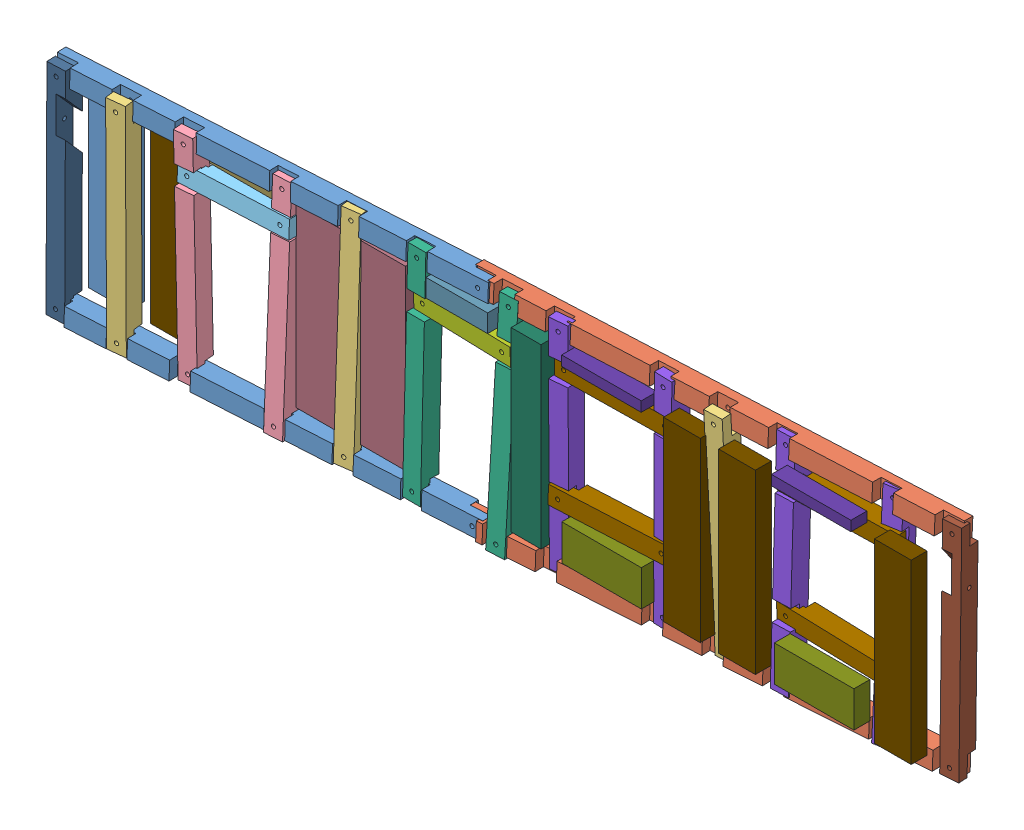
SolidWorks assembly AVANT.SLDASM, configuration Défaut (file format 3400). Lengths in mm.
Overall size (435.32 113.2 48.35).
38 component instances, 19 part files, 0 mates.
Components (placement in the parent):
- Assemblage_AV-1: Assemblage_AV.SLDASM [Défaut] at (-19.3542 -32.5689 7.2064) x (0.998266 -0.000366 -0.058865) z (0.058848 0.031064 0.997784) size (434.78 112.5 19.3)
  - Base_G-AV-1: Base_G-AV.SLDPRT [Défaut] at (-110.8161 -25.5826 3.0751) size (209 9 9)
  - Base_G-AV-2: Base_G-AV.SLDPRT [Défaut] at (-110.8715 76.586 3.2289) size (209 9 9)
  - Base_D-AV-1: Base_D-AV.SLDPRT [Défaut] at (87.1977 76.6124 2.4605) x (0.999931 0.000601 0.011708) z (-0.011718 0.020718 0.999717) size (235 9 9)
  - Base_D-AV-2: Base_D-AV.SLDPRT [Défaut] at (86.3066 -25.6939 4.7573) x (0.999931 -0.000494 -0.011732) z (0.011736 0.010297 0.999878) size (235 9 9)
  - montant-1: montant.SLDPRT [Default] at (-180.5636 17.55 19.1161) x (-0.001336 -0.999292 -0.037602) z (-0.049357 0.037622 -0.998072) size (110 9 9)
  - montant-2: montant.SLDPRT [Default] at (316.0851 42.1966 17.8366) x (-0.004468 0.996596 0.08232) z (0.023822 0.082403 -0.996314) size (110 9 9)
  - montant-3: montant.SLDPRT [Default] at (136.5542 42.6524 2.5669) x (0.000259 0.999978 -0.006578) z (-0.083118 -0.006534 -0.996518) size (110 9 9)
  - montant_3-4-1: montant_3-4.SLDPRT [Default] at (-106.0703 16.2759 12.4071) x (0.002122 -0.999879 0.01538) z (-0.004429 -0.015389 -0.999872) size (110 9 9)
  - montant_3-4-2: montant_3-4.SLDPRT [Default] at (-149.8924 16.4017 13.6541) x (0.004288 -0.998764 -0.049511) z (-0.0242 0.049393 -0.998486) size (110 9 9)
  - traverse_T1-1: traverse_T1.SLDPRT [Défaut] at (-50.0928 68.8654 11.16) x (0.999821 0.006047 0.017918) z (0.018053 -0.023077 -0.999571) size (54 9 9)
  - montant_6-7-1: montant_6-7.SLDPRT [Default] at (1.6602 17.4904 13.5063) x (-0.00909 -0.999639 0.025276) z (-0.001816 -0.02526 -0.999679) size (110 9 9)
  - montant_6-7-2: montant_6-7.SLDPRT [Default] at (-41.0756 18.5591 5.5097) x (-0.005763 -0.999918 -0.011443) z (0.058023 0.01109 -0.998254) size (110 9 9)
  - traverse_T2-1: traverse_T2.SLDPRT [Défaut] at (60.8773 64.9511 9.8675) x (0.996278 -0.004979 0.08605) z (0.086192 0.065415 -0.994129) size (50 9 9)
  - montant_T3-1: montant_T3.SLDPRT [Default] at (77.2686 18.7415 2.7682) x (-0.006691 -0.99937 -0.034863) z (0.081488 0.034203 -0.996087) size (110 9 9)
  - montant_T3-2: montant_T3.SLDPRT [Default] at (27.5773 18.2825 15.1661) x (0.000597 -0.999343 -0.036231) z (-0.03683 0.036185 -0.998666) size (110 9 9)
  - traverse_T3-1: traverse_T3.SLDPRT [Défaut] at (234.5317 10.9455 9.2261) x (0.995398 0.003735 0.095758) z (0.095211 0.074949 -0.992632) size (59 9 9)
  - traverse_T3-2: traverse_T3.SLDPRT [Défaut] at (293.6902 58.8542 12.5497) x (-0.999407 0.003553 -0.034235) z (0.03436 0.045015 -0.998395) size (59 9 9)
  - traverse_T3-3: traverse_T3.SLDPRT [Défaut] at (127.8701 12.6374 11.3566) x (0.999846 0.005976 0.016475) z (0.016346 0.02103 -0.999645) size (59 9 9)
  - traverse_T3-4: traverse_T3.SLDPRT [Défaut] at (128.5662 68.0188 10.6199) x (0.999049 -0.001077 0.043598) z (0.043608 0.036267 -0.99839) size (59 9 9)
  - montant_T3-3: montant_T3.SLDPRT [Default] at (184.7268 18.1281 24.044) x (0.001847 -0.999665 0.025808) z (-0.114227 -0.02585 -0.993118) size (110 9 9)
  - montant_T3-4: montant_T3.SLDPRT [Default] at (134.2693 16.9427 8.082) x (0.009085 -0.999909 0.009923) z (0.036114 -0.009589 -0.999302) size (110 9 9)
  - montant_1-1: montant_1.SLDPRT [Default] at (-1.4118 41.4337 13.6128) x (-0.000138 0.999636 0.026995) z (0.014592 0.026994 -0.999529) size (110 9 9)
  - montant13-30-1: montant13-30.SLDPRT [Default] at (424.2608 42.2621 10.3838) x (-0.001463 0.999872 0.015903) z (-0.014868 0.01588 -0.999763) size (110 9 9)
- AV_3-4-1: AV_3-4.SLDPRT [Défaut] at (-58.7843 37.6655 5.2761) size (35 5 8)
- AV_4-5-1: AV_4-5.SLDPRT [Défaut] at (-15.3301 -47.0798 5.2761) size (22.5 89 8)
- AV_6-7-1: AV_6-7.SLDPRT [Défaut] at (50.079 33.2908 5.2761) size (31 9 8)
- AV_7-8-1: AV_7-8.SLDPRT [Défaut] at (92.9085 -47.1455 5.2761) size (15 89 8)
- AV_8-9b-1: AV_8-9b.SLDPRT [Défaut] at (118.4044 -47.9925 5.2761) size (40 18 8)
- AV_8-9h-1: AV_8-9h.SLDPRT [Défaut] at (118.3386 37.6327 5.2761) size (40 5 8)
- AV_9-10-1: AV_9-10.SLDPRT [Défaut] at (169.5249 -47.8714 5.2761) size (18.5 89 8)
- AV_9-10-2: AV_9-10.SLDPRT [Défaut] at (275.5967 -47.8714 5.2761) size (18.5 89 8)
- AV_9-10-3: AV_9-10.SLDPRT [Défaut] at (197.2302 -47.8714 5.2761) size (18.5 89 8)
- AV_9-10-4: AV_9-10.SLDPRT [Défaut] at (-88.5302 -47.0469 5.2761) size (18.5 89 8)
- AV_8-9b-2: AV_8-9b.SLDPRT [Défaut] at (225.2677 -47.2995 5.2761) size (40 18 8)
- AV_8-9h-2: AV_8-9h.SLDPRT [Défaut] at (223.7831 38.3585 5.2761) size (40 5 8)
- AV_1-2-2: AV_1-2.SLDPRT [Défaut] at (-119.5594 -47.0359 5.2761) size (20 89 8)
- AV_4-5-2: AV_4-5.SLDPRT [Défaut] at (17.2775 -47.0359 5.2761) size (22.5 89 8)
